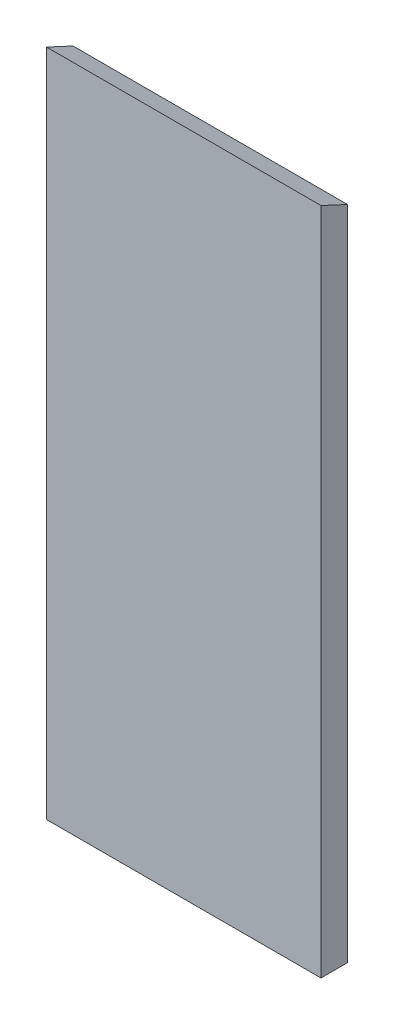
from build123d import *

# Parameters (mm, degrees)
BOSS_EXTRU_1_DEPTH = 124


with BuildPart() as part:
    # Esquisse1 → Boss.-Extru.1 (new body)
    with BuildSketch(Plane(origin=(0, 0, 0), x_dir=(0, 0, -1), z_dir=(1, 0, 0))):
        Polygon((0, 0), (12, 0), (12, 296.6), (0, 302.195691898), align=None)
    extrude(amount=BOSS_EXTRU_1_DEPTH)


solid = part.part
